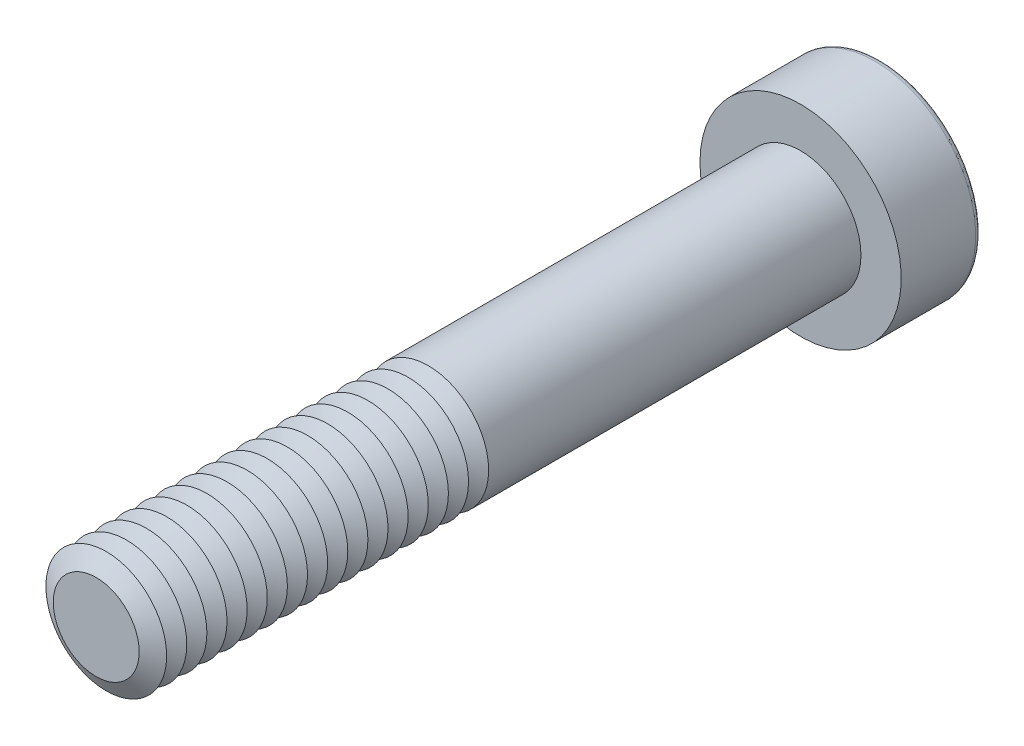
ISO-10303-21;
HEADER;
FILE_DESCRIPTION(('STEP AP214'),'2;1');
FILE_NAME('part.step','',(''),(''),'','','');
FILE_SCHEMA(('AUTOMOTIVE_DESIGN { 1 0 10303 214 1 1 1 1 }'));
ENDSEC;
DATA;
#1=APPLICATION_CONTEXT('core data for automotive mechanical design processes');
#2=APPLICATION_PROTOCOL_DEFINITION('international standard','automotive_design',2000,#1);
#3=PRODUCT_CONTEXT('',#1,'mechanical');
#4=PRODUCT('Part','Part','',(#3));
#5=PRODUCT_RELATED_PRODUCT_CATEGORY('part','',(#4));
#6=PRODUCT_DEFINITION_FORMATION('','',#4);
#7=PRODUCT_DEFINITION_CONTEXT('part definition',#1,'design');
#8=PRODUCT_DEFINITION('design','',#6,#7);
#9=PRODUCT_DEFINITION_SHAPE('','',#8);
#10=(LENGTH_UNIT() NAMED_UNIT(*) SI_UNIT(.MILLI.,.METRE.));
#11=(NAMED_UNIT(*) PLANE_ANGLE_UNIT() SI_UNIT($,.RADIAN.));
#12=(NAMED_UNIT(*) SI_UNIT($,.STERADIAN.) SOLID_ANGLE_UNIT());
#13=UNCERTAINTY_MEASURE_WITH_UNIT(LENGTH_MEASURE(1.E-05),#10,'distance_accuracy_value','');
#14=(GEOMETRIC_REPRESENTATION_CONTEXT(3) GLOBAL_UNCERTAINTY_ASSIGNED_CONTEXT((#13)) GLOBAL_UNIT_ASSIGNED_CONTEXT((#10,
#11,#12)) REPRESENTATION_CONTEXT('',''));
#15=CARTESIAN_POINT('',(0.,0.,0.));
#16=DIRECTION('',(0.,0.,1.));
#17=DIRECTION('',(1.,0.,0.));
#18=AXIS2_PLACEMENT_3D('',#15,#16,#17);
#19=CARTESIAN_POINT('',(0.,0.,31.5));
#20=DIRECTION('',(0.,0.,1.));
#21=DIRECTION('',(1.,0.,0.));
#22=AXIS2_PLACEMENT_3D('',#19,#20,#21);
#23=CONICAL_SURFACE('',#22,3.,1.0471975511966);
#24=CARTESIAN_POINT('',(0.,0.,31.));
#25=DIRECTION('',(0.,0.,1.));
#26=DIRECTION('',(1.,0.,0.));
#27=AXIS2_PLACEMENT_3D('',#24,#25,#26);
#28=CIRCLE('',#27,2.13397459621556);
#29=CARTESIAN_POINT('',(2.13397459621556,0.,31.));
#30=VERTEX_POINT('',#29);
#31=EDGE_CURVE('E310',#30,#30,#28,.T.);
#32=ORIENTED_EDGE('',*,*,#31,.T.);
#33=EDGE_LOOP('',(#32));
#34=FACE_BOUND('',#33,.T.);
#35=CARTESIAN_POINT('',(0.,0.,31.5));
#36=DIRECTION('',(0.,0.,1.));
#37=DIRECTION('',(1.,0.,0.));
#38=AXIS2_PLACEMENT_3D('',#35,#36,#37);
#39=CIRCLE('',#38,3.);
#40=CARTESIAN_POINT('',(3.,0.,31.5));
#41=VERTEX_POINT('',#40);
#42=EDGE_CURVE('E313',#41,#41,#39,.T.);
#43=ORIENTED_EDGE('',*,*,#42,.F.);
#44=EDGE_LOOP('',(#43));
#45=FACE_BOUND('',#44,.T.);
#46=ADVANCED_FACE('F39',(#34,#45),#23,.T.);
#47=CARTESIAN_POINT('',(0.,0.,31.));
#48=DIRECTION('',(0.,0.,-1.));
#49=DIRECTION('',(-1.,0.,0.));
#50=AXIS2_PLACEMENT_3D('',#47,#48,#49);
#51=CONICAL_SURFACE('',#50,2.13397459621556,1.0471975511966);
#52=CARTESIAN_POINT('',(0.,0.,30.5));
#53=DIRECTION('',(0.,0.,1.));
#54=DIRECTION('',(1.,0.,0.));
#55=AXIS2_PLACEMENT_3D('',#52,#53,#54);
#56=CIRCLE('',#55,3.);
#57=CARTESIAN_POINT('',(3.,0.,30.5));
#58=VERTEX_POINT('',#57);
#59=EDGE_CURVE('E321',#58,#58,#56,.T.);
#60=ORIENTED_EDGE('',*,*,#59,.T.);
#61=EDGE_LOOP('',(#60));
#62=FACE_BOUND('',#61,.T.);
#63=ORIENTED_EDGE('',*,*,#31,.F.);
#64=EDGE_LOOP('',(#63));
#65=FACE_BOUND('',#64,.T.);
#66=ADVANCED_FACE('F244',(#62,#65),#51,.T.);
#67=CARTESIAN_POINT('',(0.,0.,35.));
#68=DIRECTION('',(0.,0.,1.));
#69=DIRECTION('',(1.,0.,0.));
#70=AXIS2_PLACEMENT_3D('',#67,#68,#69);
#71=PLANE('',#70);
#72=CARTESIAN_POINT('',(0.,0.,35.));
#73=DIRECTION('',(0.,0.,1.));
#74=DIRECTION('',(1.,0.,0.));
#75=AXIS2_PLACEMENT_3D('',#72,#73,#74);
#76=CIRCLE('',#75,2.13397459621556);
#77=CARTESIAN_POINT('',(2.13397459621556,0.,35.));
#78=VERTEX_POINT('',#77);
#79=EDGE_CURVE('E173',#78,#78,#76,.T.);
#80=ORIENTED_EDGE('',*,*,#79,.T.);
#81=EDGE_LOOP('',(#80));
#82=FACE_BOUND('',#81,.T.);
#83=ADVANCED_FACE('F250',(#82),#71,.T.);
#84=CARTESIAN_POINT('',(0.,0.,35.));
#85=DIRECTION('',(0.,0.,-1.));
#86=DIRECTION('',(-1.,0.,0.));
#87=AXIS2_PLACEMENT_3D('',#84,#85,#86);
#88=CONICAL_SURFACE('',#87,2.13397459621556,1.0471975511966);
#89=CARTESIAN_POINT('',(0.,0.,34.5));
#90=DIRECTION('',(0.,0.,1.));
#91=DIRECTION('',(1.,0.,0.));
#92=AXIS2_PLACEMENT_3D('',#89,#90,#91);
#93=CIRCLE('',#92,3.);
#94=CARTESIAN_POINT('',(3.,0.,34.5));
#95=VERTEX_POINT('',#94);
#96=EDGE_CURVE('E290',#95,#95,#93,.T.);
#97=ORIENTED_EDGE('',*,*,#96,.T.);
#98=EDGE_LOOP('',(#97));
#99=FACE_BOUND('',#98,.T.);
#100=ORIENTED_EDGE('',*,*,#79,.F.);
#101=EDGE_LOOP('',(#100));
#102=FACE_BOUND('',#101,.T.);
#103=ADVANCED_FACE('F198',(#99,#102),#88,.T.);
#104=CARTESIAN_POINT('',(0.,0.,34.5));
#105=DIRECTION('',(0.,0.,1.));
#106=DIRECTION('',(1.,0.,0.));
#107=AXIS2_PLACEMENT_3D('',#104,#105,#106);
#108=CONICAL_SURFACE('',#107,3.,1.0471975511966);
#109=CARTESIAN_POINT('',(0.,0.,34.));
#110=DIRECTION('',(0.,0.,1.));
#111=DIRECTION('',(1.,0.,0.));
#112=AXIS2_PLACEMENT_3D('',#109,#110,#111);
#113=CIRCLE('',#112,2.13397459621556);
#114=CARTESIAN_POINT('',(2.13397459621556,0.,34.));
#115=VERTEX_POINT('',#114);
#116=EDGE_CURVE('E287',#115,#115,#113,.T.);
#117=ORIENTED_EDGE('',*,*,#116,.T.);
#118=EDGE_LOOP('',(#117));
#119=FACE_BOUND('',#118,.T.);
#120=ORIENTED_EDGE('',*,*,#96,.F.);
#121=EDGE_LOOP('',(#120));
#122=FACE_BOUND('',#121,.T.);
#123=ADVANCED_FACE('F276',(#119,#122),#108,.T.);
#124=CARTESIAN_POINT('',(0.,0.,34.));
#125=DIRECTION('',(0.,0.,-1.));
#126=DIRECTION('',(-1.,0.,0.));
#127=AXIS2_PLACEMENT_3D('',#124,#125,#126);
#128=CONICAL_SURFACE('',#127,2.13397459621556,1.0471975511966);
#129=CARTESIAN_POINT('',(0.,0.,33.5));
#130=DIRECTION('',(0.,0.,1.));
#131=DIRECTION('',(1.,0.,0.));
#132=AXIS2_PLACEMENT_3D('',#129,#130,#131);
#133=CIRCLE('',#132,3.);
#134=CARTESIAN_POINT('',(3.,0.,33.5));
#135=VERTEX_POINT('',#134);
#136=EDGE_CURVE('E297',#135,#135,#133,.T.);
#137=ORIENTED_EDGE('',*,*,#136,.T.);
#138=EDGE_LOOP('',(#137));
#139=FACE_BOUND('',#138,.T.);
#140=ORIENTED_EDGE('',*,*,#116,.F.);
#141=EDGE_LOOP('',(#140));
#142=FACE_BOUND('',#141,.T.);
#143=ADVANCED_FACE('F273',(#139,#142),#128,.T.);
#144=CARTESIAN_POINT('',(0.,0.,33.5));
#145=DIRECTION('',(0.,0.,1.));
#146=DIRECTION('',(1.,0.,0.));
#147=AXIS2_PLACEMENT_3D('',#144,#145,#146);
#148=CONICAL_SURFACE('',#147,3.,1.0471975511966);
#149=CARTESIAN_POINT('',(0.,0.,33.));
#150=DIRECTION('',(0.,0.,1.));
#151=DIRECTION('',(1.,0.,0.));
#152=AXIS2_PLACEMENT_3D('',#149,#150,#151);
#153=CIRCLE('',#152,2.13397459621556);
#154=CARTESIAN_POINT('',(2.13397459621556,0.,33.));
#155=VERTEX_POINT('',#154);
#156=EDGE_CURVE('E292',#155,#155,#153,.T.);
#157=ORIENTED_EDGE('',*,*,#156,.T.);
#158=EDGE_LOOP('',(#157));
#159=FACE_BOUND('',#158,.T.);
#160=ORIENTED_EDGE('',*,*,#136,.F.);
#161=EDGE_LOOP('',(#160));
#162=FACE_BOUND('',#161,.T.);
#163=ADVANCED_FACE('F269',(#159,#162),#148,.T.);
#164=CARTESIAN_POINT('',(0.,0.,33.));
#165=DIRECTION('',(0.,0.,-1.));
#166=DIRECTION('',(-1.,0.,0.));
#167=AXIS2_PLACEMENT_3D('',#164,#165,#166);
#168=CONICAL_SURFACE('',#167,2.13397459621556,1.0471975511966);
#169=CARTESIAN_POINT('',(0.,0.,32.5));
#170=DIRECTION('',(0.,0.,1.));
#171=DIRECTION('',(1.,0.,0.));
#172=AXIS2_PLACEMENT_3D('',#169,#170,#171);
#173=CIRCLE('',#172,3.);
#174=CARTESIAN_POINT('',(3.,0.,32.5));
#175=VERTEX_POINT('',#174);
#176=EDGE_CURVE('E306',#175,#175,#173,.T.);
#177=ORIENTED_EDGE('',*,*,#176,.T.);
#178=EDGE_LOOP('',(#177));
#179=FACE_BOUND('',#178,.T.);
#180=ORIENTED_EDGE('',*,*,#156,.F.);
#181=EDGE_LOOP('',(#180));
#182=FACE_BOUND('',#181,.T.);
#183=ADVANCED_FACE('F265',(#179,#182),#168,.T.);
#184=CARTESIAN_POINT('',(0.,0.,32.5));
#185=DIRECTION('',(0.,0.,1.));
#186=DIRECTION('',(1.,0.,0.));
#187=AXIS2_PLACEMENT_3D('',#184,#185,#186);
#188=CONICAL_SURFACE('',#187,3.,1.0471975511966);
#189=CARTESIAN_POINT('',(0.,0.,32.));
#190=DIRECTION('',(0.,0.,1.));
#191=DIRECTION('',(1.,0.,0.));
#192=AXIS2_PLACEMENT_3D('',#189,#190,#191);
#193=CIRCLE('',#192,2.13397459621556);
#194=CARTESIAN_POINT('',(2.13397459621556,0.,32.));
#195=VERTEX_POINT('',#194);
#196=EDGE_CURVE('E302',#195,#195,#193,.T.);
#197=ORIENTED_EDGE('',*,*,#196,.T.);
#198=EDGE_LOOP('',(#197));
#199=FACE_BOUND('',#198,.T.);
#200=ORIENTED_EDGE('',*,*,#176,.F.);
#201=EDGE_LOOP('',(#200));
#202=FACE_BOUND('',#201,.T.);
#203=ADVANCED_FACE('F261',(#199,#202),#188,.T.);
#204=CARTESIAN_POINT('',(0.,0.,32.));
#205=DIRECTION('',(0.,0.,-1.));
#206=DIRECTION('',(-1.,0.,0.));
#207=AXIS2_PLACEMENT_3D('',#204,#205,#206);
#208=CONICAL_SURFACE('',#207,2.13397459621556,1.0471975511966);
#209=ORIENTED_EDGE('',*,*,#42,.T.);
#210=EDGE_LOOP('',(#209));
#211=FACE_BOUND('',#210,.T.);
#212=ORIENTED_EDGE('',*,*,#196,.F.);
#213=EDGE_LOOP('',(#212));
#214=FACE_BOUND('',#213,.T.);
#215=ADVANCED_FACE('F257',(#211,#214),#208,.T.);
#216=CARTESIAN_POINT('',(0.,0.,30.5));
#217=DIRECTION('',(0.,0.,1.));
#218=DIRECTION('',(1.,0.,0.));
#219=AXIS2_PLACEMENT_3D('',#216,#217,#218);
#220=CONICAL_SURFACE('',#219,3.,1.0471975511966);
#221=CARTESIAN_POINT('',(0.,0.,30.));
#222=DIRECTION('',(0.,0.,1.));
#223=DIRECTION('',(1.,0.,0.));
#224=AXIS2_PLACEMENT_3D('',#221,#222,#223);
#225=CIRCLE('',#224,2.13397459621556);
#226=CARTESIAN_POINT('',(2.13397459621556,0.,30.));
#227=VERTEX_POINT('',#226);
#228=EDGE_CURVE('E317',#227,#227,#225,.T.);
#229=ORIENTED_EDGE('',*,*,#228,.T.);
#230=EDGE_LOOP('',(#229));
#231=FACE_BOUND('',#230,.T.);
#232=ORIENTED_EDGE('',*,*,#59,.F.);
#233=EDGE_LOOP('',(#232));
#234=FACE_BOUND('',#233,.T.);
#235=ADVANCED_FACE('F260',(#231,#234),#220,.T.);
#236=CARTESIAN_POINT('',(0.,0.,30.));
#237=DIRECTION('',(0.,0.,-1.));
#238=DIRECTION('',(-1.,0.,0.));
#239=AXIS2_PLACEMENT_3D('',#236,#237,#238);
#240=CONICAL_SURFACE('',#239,2.13397459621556,1.0471975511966);
#241=CARTESIAN_POINT('',(0.,0.,29.5));
#242=DIRECTION('',(0.,0.,1.));
#243=DIRECTION('',(1.,0.,0.));
#244=AXIS2_PLACEMENT_3D('',#241,#242,#243);
#245=CIRCLE('',#244,3.);
#246=CARTESIAN_POINT('',(3.,0.,29.5));
#247=VERTEX_POINT('',#246);
#248=EDGE_CURVE('E329',#247,#247,#245,.T.);
#249=ORIENTED_EDGE('',*,*,#248,.T.);
#250=EDGE_LOOP('',(#249));
#251=FACE_BOUND('',#250,.T.);
#252=ORIENTED_EDGE('',*,*,#228,.F.);
#253=EDGE_LOOP('',(#252));
#254=FACE_BOUND('',#253,.T.);
#255=ADVANCED_FACE('F510',(#251,#254),#240,.T.);
#256=CARTESIAN_POINT('',(0.,0.,29.5));
#257=DIRECTION('',(0.,0.,1.));
#258=DIRECTION('',(1.,0.,0.));
#259=AXIS2_PLACEMENT_3D('',#256,#257,#258);
#260=CONICAL_SURFACE('',#259,3.,1.0471975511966);
#261=CARTESIAN_POINT('',(0.,0.,29.));
#262=DIRECTION('',(0.,0.,1.));
#263=DIRECTION('',(1.,0.,0.));
#264=AXIS2_PLACEMENT_3D('',#261,#262,#263);
#265=CIRCLE('',#264,2.13397459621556);
#266=CARTESIAN_POINT('',(2.13397459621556,0.,29.));
#267=VERTEX_POINT('',#266);
#268=EDGE_CURVE('E325',#267,#267,#265,.T.);
#269=ORIENTED_EDGE('',*,*,#268,.T.);
#270=EDGE_LOOP('',(#269));
#271=FACE_BOUND('',#270,.T.);
#272=ORIENTED_EDGE('',*,*,#248,.F.);
#273=EDGE_LOOP('',(#272));
#274=FACE_BOUND('',#273,.T.);
#275=ADVANCED_FACE('F506',(#271,#274),#260,.T.);
#276=CARTESIAN_POINT('',(0.,0.,29.));
#277=DIRECTION('',(0.,0.,-1.));
#278=DIRECTION('',(-1.,0.,0.));
#279=AXIS2_PLACEMENT_3D('',#276,#277,#278);
#280=CONICAL_SURFACE('',#279,2.13397459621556,1.0471975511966);
#281=CARTESIAN_POINT('',(0.,0.,28.5));
#282=DIRECTION('',(0.,0.,1.));
#283=DIRECTION('',(1.,0.,0.));
#284=AXIS2_PLACEMENT_3D('',#281,#282,#283);
#285=CIRCLE('',#284,3.);
#286=CARTESIAN_POINT('',(3.,0.,28.5));
#287=VERTEX_POINT('',#286);
#288=EDGE_CURVE('E337',#287,#287,#285,.T.);
#289=ORIENTED_EDGE('',*,*,#288,.T.);
#290=EDGE_LOOP('',(#289));
#291=FACE_BOUND('',#290,.T.);
#292=ORIENTED_EDGE('',*,*,#268,.F.);
#293=EDGE_LOOP('',(#292));
#294=FACE_BOUND('',#293,.T.);
#295=ADVANCED_FACE('F502',(#291,#294),#280,.T.);
#296=CARTESIAN_POINT('',(0.,0.,28.5));
#297=DIRECTION('',(0.,0.,1.));
#298=DIRECTION('',(1.,0.,0.));
#299=AXIS2_PLACEMENT_3D('',#296,#297,#298);
#300=CONICAL_SURFACE('',#299,3.,1.0471975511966);
#301=CARTESIAN_POINT('',(0.,0.,28.));
#302=DIRECTION('',(0.,0.,1.));
#303=DIRECTION('',(1.,0.,0.));
#304=AXIS2_PLACEMENT_3D('',#301,#302,#303);
#305=CIRCLE('',#304,2.13397459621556);
#306=CARTESIAN_POINT('',(2.13397459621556,0.,28.));
#307=VERTEX_POINT('',#306);
#308=EDGE_CURVE('E333',#307,#307,#305,.T.);
#309=ORIENTED_EDGE('',*,*,#308,.T.);
#310=EDGE_LOOP('',(#309));
#311=FACE_BOUND('',#310,.T.);
#312=ORIENTED_EDGE('',*,*,#288,.F.);
#313=EDGE_LOOP('',(#312));
#314=FACE_BOUND('',#313,.T.);
#315=ADVANCED_FACE('F498',(#311,#314),#300,.T.);
#316=CARTESIAN_POINT('',(0.,0.,28.));
#317=DIRECTION('',(0.,0.,-1.));
#318=DIRECTION('',(-1.,0.,0.));
#319=AXIS2_PLACEMENT_3D('',#316,#317,#318);
#320=CONICAL_SURFACE('',#319,2.13397459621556,1.0471975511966);
#321=CARTESIAN_POINT('',(0.,0.,27.5));
#322=DIRECTION('',(0.,0.,1.));
#323=DIRECTION('',(1.,0.,0.));
#324=AXIS2_PLACEMENT_3D('',#321,#322,#323);
#325=CIRCLE('',#324,3.);
#326=CARTESIAN_POINT('',(3.,0.,27.5));
#327=VERTEX_POINT('',#326);
#328=EDGE_CURVE('E345',#327,#327,#325,.T.);
#329=ORIENTED_EDGE('',*,*,#328,.T.);
#330=EDGE_LOOP('',(#329));
#331=FACE_BOUND('',#330,.T.);
#332=ORIENTED_EDGE('',*,*,#308,.F.);
#333=EDGE_LOOP('',(#332));
#334=FACE_BOUND('',#333,.T.);
#335=ADVANCED_FACE('F494',(#331,#334),#320,.T.);
#336=CARTESIAN_POINT('',(0.,0.,27.5));
#337=DIRECTION('',(0.,0.,1.));
#338=DIRECTION('',(1.,0.,0.));
#339=AXIS2_PLACEMENT_3D('',#336,#337,#338);
#340=CONICAL_SURFACE('',#339,3.,1.0471975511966);
#341=CARTESIAN_POINT('',(0.,0.,27.));
#342=DIRECTION('',(0.,0.,1.));
#343=DIRECTION('',(1.,0.,0.));
#344=AXIS2_PLACEMENT_3D('',#341,#342,#343);
#345=CIRCLE('',#344,2.13397459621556);
#346=CARTESIAN_POINT('',(2.13397459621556,0.,27.));
#347=VERTEX_POINT('',#346);
#348=EDGE_CURVE('E341',#347,#347,#345,.T.);
#349=ORIENTED_EDGE('',*,*,#348,.T.);
#350=EDGE_LOOP('',(#349));
#351=FACE_BOUND('',#350,.T.);
#352=ORIENTED_EDGE('',*,*,#328,.F.);
#353=EDGE_LOOP('',(#352));
#354=FACE_BOUND('',#353,.T.);
#355=ADVANCED_FACE('F490',(#351,#354),#340,.T.);
#356=CARTESIAN_POINT('',(0.,0.,27.));
#357=DIRECTION('',(0.,0.,-1.));
#358=DIRECTION('',(-1.,0.,0.));
#359=AXIS2_PLACEMENT_3D('',#356,#357,#358);
#360=CONICAL_SURFACE('',#359,2.13397459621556,1.0471975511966);
#361=CARTESIAN_POINT('',(0.,0.,26.5));
#362=DIRECTION('',(0.,0.,1.));
#363=DIRECTION('',(1.,0.,0.));
#364=AXIS2_PLACEMENT_3D('',#361,#362,#363);
#365=CIRCLE('',#364,3.);
#366=CARTESIAN_POINT('',(3.,0.,26.5));
#367=VERTEX_POINT('',#366);
#368=EDGE_CURVE('E353',#367,#367,#365,.T.);
#369=ORIENTED_EDGE('',*,*,#368,.T.);
#370=EDGE_LOOP('',(#369));
#371=FACE_BOUND('',#370,.T.);
#372=ORIENTED_EDGE('',*,*,#348,.F.);
#373=EDGE_LOOP('',(#372));
#374=FACE_BOUND('',#373,.T.);
#375=ADVANCED_FACE('F486',(#371,#374),#360,.T.);
#376=CARTESIAN_POINT('',(0.,0.,26.5));
#377=DIRECTION('',(0.,0.,1.));
#378=DIRECTION('',(1.,0.,0.));
#379=AXIS2_PLACEMENT_3D('',#376,#377,#378);
#380=CONICAL_SURFACE('',#379,3.,1.0471975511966);
#381=CARTESIAN_POINT('',(0.,0.,26.));
#382=DIRECTION('',(0.,0.,1.));
#383=DIRECTION('',(1.,0.,0.));
#384=AXIS2_PLACEMENT_3D('',#381,#382,#383);
#385=CIRCLE('',#384,2.13397459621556);
#386=CARTESIAN_POINT('',(2.13397459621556,0.,26.));
#387=VERTEX_POINT('',#386);
#388=EDGE_CURVE('E349',#387,#387,#385,.T.);
#389=ORIENTED_EDGE('',*,*,#388,.T.);
#390=EDGE_LOOP('',(#389));
#391=FACE_BOUND('',#390,.T.);
#392=ORIENTED_EDGE('',*,*,#368,.F.);
#393=EDGE_LOOP('',(#392));
#394=FACE_BOUND('',#393,.T.);
#395=ADVANCED_FACE('F482',(#391,#394),#380,.T.);
#396=CARTESIAN_POINT('',(0.,0.,26.));
#397=DIRECTION('',(0.,0.,-1.));
#398=DIRECTION('',(-1.,0.,0.));
#399=AXIS2_PLACEMENT_3D('',#396,#397,#398);
#400=CONICAL_SURFACE('',#399,2.13397459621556,1.0471975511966);
#401=CARTESIAN_POINT('',(0.,0.,25.5));
#402=DIRECTION('',(0.,0.,1.));
#403=DIRECTION('',(1.,0.,0.));
#404=AXIS2_PLACEMENT_3D('',#401,#402,#403);
#405=CIRCLE('',#404,3.);
#406=CARTESIAN_POINT('',(3.,0.,25.5));
#407=VERTEX_POINT('',#406);
#408=EDGE_CURVE('E361',#407,#407,#405,.T.);
#409=ORIENTED_EDGE('',*,*,#408,.T.);
#410=EDGE_LOOP('',(#409));
#411=FACE_BOUND('',#410,.T.);
#412=ORIENTED_EDGE('',*,*,#388,.F.);
#413=EDGE_LOOP('',(#412));
#414=FACE_BOUND('',#413,.T.);
#415=ADVANCED_FACE('F478',(#411,#414),#400,.T.);
#416=CARTESIAN_POINT('',(0.,0.,25.5));
#417=DIRECTION('',(0.,0.,1.));
#418=DIRECTION('',(1.,0.,0.));
#419=AXIS2_PLACEMENT_3D('',#416,#417,#418);
#420=CONICAL_SURFACE('',#419,3.,1.0471975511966);
#421=CARTESIAN_POINT('',(0.,0.,25.));
#422=DIRECTION('',(0.,0.,1.));
#423=DIRECTION('',(1.,0.,0.));
#424=AXIS2_PLACEMENT_3D('',#421,#422,#423);
#425=CIRCLE('',#424,2.13397459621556);
#426=CARTESIAN_POINT('',(2.13397459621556,0.,25.));
#427=VERTEX_POINT('',#426);
#428=EDGE_CURVE('E357',#427,#427,#425,.T.);
#429=ORIENTED_EDGE('',*,*,#428,.T.);
#430=EDGE_LOOP('',(#429));
#431=FACE_BOUND('',#430,.T.);
#432=ORIENTED_EDGE('',*,*,#408,.F.);
#433=EDGE_LOOP('',(#432));
#434=FACE_BOUND('',#433,.T.);
#435=ADVANCED_FACE('F474',(#431,#434),#420,.T.);
#436=CARTESIAN_POINT('',(0.,0.,25.));
#437=DIRECTION('',(0.,0.,-1.));
#438=DIRECTION('',(-1.,0.,0.));
#439=AXIS2_PLACEMENT_3D('',#436,#437,#438);
#440=CONICAL_SURFACE('',#439,2.13397459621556,1.0471975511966);
#441=CARTESIAN_POINT('',(0.,0.,24.5));
#442=DIRECTION('',(0.,0.,1.));
#443=DIRECTION('',(1.,0.,0.));
#444=AXIS2_PLACEMENT_3D('',#441,#442,#443);
#445=CIRCLE('',#444,3.);
#446=CARTESIAN_POINT('',(3.,0.,24.5));
#447=VERTEX_POINT('',#446);
#448=EDGE_CURVE('E369',#447,#447,#445,.T.);
#449=ORIENTED_EDGE('',*,*,#448,.T.);
#450=EDGE_LOOP('',(#449));
#451=FACE_BOUND('',#450,.T.);
#452=ORIENTED_EDGE('',*,*,#428,.F.);
#453=EDGE_LOOP('',(#452));
#454=FACE_BOUND('',#453,.T.);
#455=ADVANCED_FACE('F470',(#451,#454),#440,.T.);
#456=CARTESIAN_POINT('',(0.,0.,24.5));
#457=DIRECTION('',(0.,0.,1.));
#458=DIRECTION('',(1.,0.,0.));
#459=AXIS2_PLACEMENT_3D('',#456,#457,#458);
#460=CONICAL_SURFACE('',#459,3.,1.0471975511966);
#461=CARTESIAN_POINT('',(0.,0.,24.));
#462=DIRECTION('',(0.,0.,1.));
#463=DIRECTION('',(1.,0.,0.));
#464=AXIS2_PLACEMENT_3D('',#461,#462,#463);
#465=CIRCLE('',#464,2.13397459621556);
#466=CARTESIAN_POINT('',(2.13397459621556,0.,24.));
#467=VERTEX_POINT('',#466);
#468=EDGE_CURVE('E365',#467,#467,#465,.T.);
#469=ORIENTED_EDGE('',*,*,#468,.T.);
#470=EDGE_LOOP('',(#469));
#471=FACE_BOUND('',#470,.T.);
#472=ORIENTED_EDGE('',*,*,#448,.F.);
#473=EDGE_LOOP('',(#472));
#474=FACE_BOUND('',#473,.T.);
#475=ADVANCED_FACE('F466',(#471,#474),#460,.T.);
#476=CARTESIAN_POINT('',(0.,0.,24.));
#477=DIRECTION('',(0.,0.,-1.));
#478=DIRECTION('',(-1.,0.,0.));
#479=AXIS2_PLACEMENT_3D('',#476,#477,#478);
#480=CONICAL_SURFACE('',#479,2.13397459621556,1.0471975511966);
#481=CARTESIAN_POINT('',(0.,0.,23.5));
#482=DIRECTION('',(0.,0.,1.));
#483=DIRECTION('',(1.,0.,0.));
#484=AXIS2_PLACEMENT_3D('',#481,#482,#483);
#485=CIRCLE('',#484,3.);
#486=CARTESIAN_POINT('',(3.,0.,23.5));
#487=VERTEX_POINT('',#486);
#488=EDGE_CURVE('E377',#487,#487,#485,.T.);
#489=ORIENTED_EDGE('',*,*,#488,.T.);
#490=EDGE_LOOP('',(#489));
#491=FACE_BOUND('',#490,.T.);
#492=ORIENTED_EDGE('',*,*,#468,.F.);
#493=EDGE_LOOP('',(#492));
#494=FACE_BOUND('',#493,.T.);
#495=ADVANCED_FACE('F462',(#491,#494),#480,.T.);
#496=CARTESIAN_POINT('',(0.,0.,23.5));
#497=DIRECTION('',(0.,0.,1.));
#498=DIRECTION('',(1.,0.,0.));
#499=AXIS2_PLACEMENT_3D('',#496,#497,#498);
#500=CONICAL_SURFACE('',#499,3.,1.0471975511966);
#501=CARTESIAN_POINT('',(0.,0.,23.));
#502=DIRECTION('',(0.,0.,1.));
#503=DIRECTION('',(1.,0.,0.));
#504=AXIS2_PLACEMENT_3D('',#501,#502,#503);
#505=CIRCLE('',#504,2.13397459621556);
#506=CARTESIAN_POINT('',(2.13397459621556,0.,23.));
#507=VERTEX_POINT('',#506);
#508=EDGE_CURVE('E373',#507,#507,#505,.T.);
#509=ORIENTED_EDGE('',*,*,#508,.T.);
#510=EDGE_LOOP('',(#509));
#511=FACE_BOUND('',#510,.T.);
#512=ORIENTED_EDGE('',*,*,#488,.F.);
#513=EDGE_LOOP('',(#512));
#514=FACE_BOUND('',#513,.T.);
#515=ADVANCED_FACE('F458',(#511,#514),#500,.T.);
#516=CARTESIAN_POINT('',(0.,0.,23.));
#517=DIRECTION('',(0.,0.,-1.));
#518=DIRECTION('',(-1.,0.,0.));
#519=AXIS2_PLACEMENT_3D('',#516,#517,#518);
#520=CONICAL_SURFACE('',#519,2.13397459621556,1.0471975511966);
#521=CARTESIAN_POINT('',(0.,0.,22.5));
#522=DIRECTION('',(0.,0.,1.));
#523=DIRECTION('',(1.,0.,0.));
#524=AXIS2_PLACEMENT_3D('',#521,#522,#523);
#525=CIRCLE('',#524,3.);
#526=CARTESIAN_POINT('',(3.,0.,22.5));
#527=VERTEX_POINT('',#526);
#528=EDGE_CURVE('E385',#527,#527,#525,.T.);
#529=ORIENTED_EDGE('',*,*,#528,.T.);
#530=EDGE_LOOP('',(#529));
#531=FACE_BOUND('',#530,.T.);
#532=ORIENTED_EDGE('',*,*,#508,.F.);
#533=EDGE_LOOP('',(#532));
#534=FACE_BOUND('',#533,.T.);
#535=ADVANCED_FACE('F454',(#531,#534),#520,.T.);
#536=CARTESIAN_POINT('',(0.,0.,22.5));
#537=DIRECTION('',(0.,0.,1.));
#538=DIRECTION('',(1.,0.,0.));
#539=AXIS2_PLACEMENT_3D('',#536,#537,#538);
#540=CONICAL_SURFACE('',#539,3.,1.0471975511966);
#541=CARTESIAN_POINT('',(0.,0.,22.));
#542=DIRECTION('',(0.,0.,1.));
#543=DIRECTION('',(1.,0.,0.));
#544=AXIS2_PLACEMENT_3D('',#541,#542,#543);
#545=CIRCLE('',#544,2.13397459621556);
#546=CARTESIAN_POINT('',(2.13397459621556,0.,22.));
#547=VERTEX_POINT('',#546);
#548=EDGE_CURVE('E381',#547,#547,#545,.T.);
#549=ORIENTED_EDGE('',*,*,#548,.T.);
#550=EDGE_LOOP('',(#549));
#551=FACE_BOUND('',#550,.T.);
#552=ORIENTED_EDGE('',*,*,#528,.F.);
#553=EDGE_LOOP('',(#552));
#554=FACE_BOUND('',#553,.T.);
#555=ADVANCED_FACE('F450',(#551,#554),#540,.T.);
#556=CARTESIAN_POINT('',(0.,0.,22.));
#557=DIRECTION('',(0.,0.,-1.));
#558=DIRECTION('',(-1.,0.,0.));
#559=AXIS2_PLACEMENT_3D('',#556,#557,#558);
#560=CONICAL_SURFACE('',#559,2.13397459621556,1.0471975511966);
#561=CARTESIAN_POINT('',(0.,0.,21.5));
#562=DIRECTION('',(0.,0.,1.));
#563=DIRECTION('',(1.,0.,0.));
#564=AXIS2_PLACEMENT_3D('',#561,#562,#563);
#565=CIRCLE('',#564,3.);
#566=CARTESIAN_POINT('',(3.,0.,21.5));
#567=VERTEX_POINT('',#566);
#568=EDGE_CURVE('E393',#567,#567,#565,.T.);
#569=ORIENTED_EDGE('',*,*,#568,.T.);
#570=EDGE_LOOP('',(#569));
#571=FACE_BOUND('',#570,.T.);
#572=ORIENTED_EDGE('',*,*,#548,.F.);
#573=EDGE_LOOP('',(#572));
#574=FACE_BOUND('',#573,.T.);
#575=ADVANCED_FACE('F446',(#571,#574),#560,.T.);
#576=CARTESIAN_POINT('',(0.,0.,21.5));
#577=DIRECTION('',(0.,0.,1.));
#578=DIRECTION('',(1.,0.,0.));
#579=AXIS2_PLACEMENT_3D('',#576,#577,#578);
#580=CONICAL_SURFACE('',#579,3.,1.0471975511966);
#581=CARTESIAN_POINT('',(0.,0.,21.));
#582=DIRECTION('',(0.,0.,1.));
#583=DIRECTION('',(1.,0.,0.));
#584=AXIS2_PLACEMENT_3D('',#581,#582,#583);
#585=CIRCLE('',#584,2.13397459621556);
#586=CARTESIAN_POINT('',(2.13397459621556,0.,21.));
#587=VERTEX_POINT('',#586);
#588=EDGE_CURVE('E389',#587,#587,#585,.T.);
#589=ORIENTED_EDGE('',*,*,#588,.T.);
#590=EDGE_LOOP('',(#589));
#591=FACE_BOUND('',#590,.T.);
#592=ORIENTED_EDGE('',*,*,#568,.F.);
#593=EDGE_LOOP('',(#592));
#594=FACE_BOUND('',#593,.T.);
#595=ADVANCED_FACE('F442',(#591,#594),#580,.T.);
#596=CARTESIAN_POINT('',(0.,0.,21.));
#597=DIRECTION('',(0.,0.,-1.));
#598=DIRECTION('',(-1.,0.,0.));
#599=AXIS2_PLACEMENT_3D('',#596,#597,#598);
#600=CONICAL_SURFACE('',#599,2.13397459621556,1.0471975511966);
#601=CARTESIAN_POINT('',(0.,0.,20.5));
#602=DIRECTION('',(0.,0.,1.));
#603=DIRECTION('',(1.,0.,0.));
#604=AXIS2_PLACEMENT_3D('',#601,#602,#603);
#605=CIRCLE('',#604,3.);
#606=CARTESIAN_POINT('',(3.,0.,20.5));
#607=VERTEX_POINT('',#606);
#608=EDGE_CURVE('E401',#607,#607,#605,.T.);
#609=ORIENTED_EDGE('',*,*,#608,.T.);
#610=EDGE_LOOP('',(#609));
#611=FACE_BOUND('',#610,.T.);
#612=ORIENTED_EDGE('',*,*,#588,.F.);
#613=EDGE_LOOP('',(#612));
#614=FACE_BOUND('',#613,.T.);
#615=ADVANCED_FACE('F438',(#611,#614),#600,.T.);
#616=CARTESIAN_POINT('',(0.,0.,20.5));
#617=DIRECTION('',(0.,0.,1.));
#618=DIRECTION('',(1.,0.,0.));
#619=AXIS2_PLACEMENT_3D('',#616,#617,#618);
#620=CONICAL_SURFACE('',#619,3.,1.0471975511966);
#621=CARTESIAN_POINT('',(0.,0.,20.));
#622=DIRECTION('',(0.,0.,1.));
#623=DIRECTION('',(1.,0.,0.));
#624=AXIS2_PLACEMENT_3D('',#621,#622,#623);
#625=CIRCLE('',#624,2.13397459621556);
#626=CARTESIAN_POINT('',(2.13397459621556,0.,20.));
#627=VERTEX_POINT('',#626);
#628=EDGE_CURVE('E397',#627,#627,#625,.T.);
#629=ORIENTED_EDGE('',*,*,#628,.T.);
#630=EDGE_LOOP('',(#629));
#631=FACE_BOUND('',#630,.T.);
#632=ORIENTED_EDGE('',*,*,#608,.F.);
#633=EDGE_LOOP('',(#632));
#634=FACE_BOUND('',#633,.T.);
#635=ADVANCED_FACE('F433',(#631,#634),#620,.T.);
#636=CARTESIAN_POINT('',(0.,0.,20.));
#637=DIRECTION('',(0.,0.,-1.));
#638=DIRECTION('',(-1.,0.,0.));
#639=AXIS2_PLACEMENT_3D('',#636,#637,#638);
#640=CONICAL_SURFACE('',#639,2.13397459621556,1.0471975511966);
#641=CARTESIAN_POINT('',(0.,0.,19.5));
#642=DIRECTION('',(0.,0.,1.));
#643=DIRECTION('',(1.,0.,0.));
#644=AXIS2_PLACEMENT_3D('',#641,#642,#643);
#645=CIRCLE('',#644,3.);
#646=CARTESIAN_POINT('',(3.,0.,19.5));
#647=VERTEX_POINT('',#646);
#648=EDGE_CURVE('E413',#647,#647,#645,.T.);
#649=ORIENTED_EDGE('',*,*,#648,.T.);
#650=EDGE_LOOP('',(#649));
#651=FACE_BOUND('',#650,.T.);
#652=ORIENTED_EDGE('',*,*,#628,.F.);
#653=EDGE_LOOP('',(#652));
#654=FACE_BOUND('',#653,.T.);
#655=ADVANCED_FACE('F419',(#651,#654),#640,.T.);
#656=CARTESIAN_POINT('',(0.,0.,19.5));
#657=DIRECTION('',(0.,0.,1.));
#658=DIRECTION('',(1.,0.,0.));
#659=AXIS2_PLACEMENT_3D('',#656,#657,#658);
#660=CONICAL_SURFACE('',#659,3.,1.0471975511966);
#661=CARTESIAN_POINT('',(0.,0.,19.));
#662=DIRECTION('',(0.,0.,1.));
#663=DIRECTION('',(1.,0.,0.));
#664=AXIS2_PLACEMENT_3D('',#661,#662,#663);
#665=CIRCLE('',#664,2.13397459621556);
#666=CARTESIAN_POINT('',(2.13397459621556,0.,19.));
#667=VERTEX_POINT('',#666);
#668=EDGE_CURVE('E405',#667,#667,#665,.T.);
#669=ORIENTED_EDGE('',*,*,#668,.T.);
#670=EDGE_LOOP('',(#669));
#671=FACE_BOUND('',#670,.T.);
#672=ORIENTED_EDGE('',*,*,#648,.F.);
#673=EDGE_LOOP('',(#672));
#674=FACE_BOUND('',#673,.T.);
#675=ADVANCED_FACE('F422',(#671,#674),#660,.T.);
#676=CARTESIAN_POINT('',(0.,0.,19.));
#677=DIRECTION('',(0.,0.,-1.));
#678=DIRECTION('',(-1.,0.,0.));
#679=AXIS2_PLACEMENT_3D('',#676,#677,#678);
#680=CONICAL_SURFACE('',#679,2.13397459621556,1.0471975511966);
#681=CARTESIAN_POINT('',(0.,0.,18.5));
#682=DIRECTION('',(0.,0.,1.));
#683=DIRECTION('',(1.,0.,0.));
#684=AXIS2_PLACEMENT_3D('',#681,#682,#683);
#685=CIRCLE('',#684,3.);
#686=CARTESIAN_POINT('',(3.,0.,18.5));
#687=VERTEX_POINT('',#686);
#688=EDGE_CURVE('E409',#687,#687,#685,.T.);
#689=ORIENTED_EDGE('',*,*,#688,.T.);
#690=EDGE_LOOP('',(#689));
#691=FACE_BOUND('',#690,.T.);
#692=ORIENTED_EDGE('',*,*,#668,.F.);
#693=EDGE_LOOP('',(#692));
#694=FACE_BOUND('',#693,.T.);
#695=ADVANCED_FACE('F424',(#691,#694),#680,.T.);
#696=CARTESIAN_POINT('',(0.,0.,-1.));
#697=DIRECTION('',(0.,0.,-1.));
#698=DIRECTION('',(-1.,0.,0.));
#699=AXIS2_PLACEMENT_3D('',#696,#697,#698);
#700=CONICAL_SURFACE('',#699,2.,1.0471975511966);
#701=CARTESIAN_POINT('',(0.,0.,0.154700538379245));
#702=VERTEX_POINT('',#701);
#703=VERTEX_LOOP('',#702);
#704=FACE_BOUND('',#703,.T.);
#705=CARTESIAN_POINT('',(0.,0.,-1.));
#706=DIRECTION('',(0.,0.,-1.));
#707=DIRECTION('',(-1.,0.,0.));
#708=AXIS2_PLACEMENT_3D('',#705,#706,#707);
#709=CIRCLE('',#708,2.);
#710=CARTESIAN_POINT('',(-1.73205080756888,0.999999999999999,-1.));
#711=VERTEX_POINT('',#710);
#712=CARTESIAN_POINT('',(0.,2.,-1.));
#713=VERTEX_POINT('',#712);
#714=EDGE_CURVE('E149',#711,#713,#709,.T.);
#715=ORIENTED_EDGE('',*,*,#714,.T.);
#716=CARTESIAN_POINT('',(0.,0.,-1.));
#717=DIRECTION('',(0.,0.,-1.));
#718=DIRECTION('',(-1.,0.,0.));
#719=AXIS2_PLACEMENT_3D('',#716,#717,#718);
#720=CIRCLE('',#719,2.);
#721=CARTESIAN_POINT('',(1.73205080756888,1.,-1.));
#722=VERTEX_POINT('',#721);
#723=EDGE_CURVE('E54',#713,#722,#720,.T.);
#724=ORIENTED_EDGE('',*,*,#723,.T.);
#725=CARTESIAN_POINT('',(1.73205080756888,-0.999999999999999,-1.));
#726=VERTEX_POINT('',#725);
#727=EDGE_CURVE('E1027',#722,#726,#720,.T.);
#728=ORIENTED_EDGE('',*,*,#727,.T.);
#729=CARTESIAN_POINT('',(0.,-2.,-1.));
#730=VERTEX_POINT('',#729);
#731=EDGE_CURVE('E1025',#726,#730,#720,.T.);
#732=ORIENTED_EDGE('',*,*,#731,.T.);
#733=CARTESIAN_POINT('',(-1.73205080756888,-0.999999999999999,-1.));
#734=VERTEX_POINT('',#733);
#735=EDGE_CURVE('E1020',#730,#734,#720,.T.);
#736=ORIENTED_EDGE('',*,*,#735,.T.);
#737=EDGE_CURVE('E1018',#734,#711,#720,.T.);
#738=ORIENTED_EDGE('',*,*,#737,.T.);
#739=EDGE_LOOP('',(#715,#724,#728,#732,#736,#738));
#740=FACE_BOUND('',#739,.T.);
#741=ADVANCED_FACE('F200',(#704,#740),#700,.F.);
#742=CARTESIAN_POINT('',(0.,0.,-1.));
#743=DIRECTION('',(0.,0.,-1.));
#744=DIRECTION('',(-1.,0.,0.));
#745=AXIS2_PLACEMENT_3D('',#742,#743,#744);
#746=PLANE('',#745);
#747=ORIENTED_EDGE('',*,*,#723,.F.);
#748=DIRECTION('',(1.,0.,0.));
#749=VECTOR('',#748,1.);
#750=CARTESIAN_POINT('',(-1.15470053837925,2.,-1.));
#751=LINE('',#750,#749);
#752=CARTESIAN_POINT('',(1.15470053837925,2.,-1.));
#753=VERTEX_POINT('',#752);
#754=EDGE_CURVE('E1067',#713,#753,#751,.T.);
#755=ORIENTED_EDGE('',*,*,#754,.T.);
#756=DIRECTION('',(0.5,-0.866025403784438,0.));
#757=VECTOR('',#756,1.);
#758=CARTESIAN_POINT('',(1.15470053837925,2.,-1.));
#759=LINE('',#758,#757);
#760=EDGE_CURVE('E155',#753,#722,#759,.T.);
#761=ORIENTED_EDGE('',*,*,#760,.T.);
#762=EDGE_LOOP('',(#747,#755,#761));
#763=FACE_BOUND('',#762,.T.);
#764=ADVANCED_FACE('F605',(#763),#746,.T.);
#765=ORIENTED_EDGE('',*,*,#727,.F.);
#766=CARTESIAN_POINT('',(2.3094010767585,0.,-1.));
#767=VERTEX_POINT('',#766);
#768=EDGE_CURVE('E1069',#722,#767,#759,.T.);
#769=ORIENTED_EDGE('',*,*,#768,.T.);
#770=DIRECTION('',(-0.5,-0.866025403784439,0.));
#771=VECTOR('',#770,1.);
#772=CARTESIAN_POINT('',(2.3094010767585,0.,-1.));
#773=LINE('',#772,#771);
#774=EDGE_CURVE('E1040',#767,#726,#773,.T.);
#775=ORIENTED_EDGE('',*,*,#774,.T.);
#776=EDGE_LOOP('',(#765,#769,#775));
#777=FACE_BOUND('',#776,.T.);
#778=ADVANCED_FACE('F615',(#777),#746,.T.);
#779=ORIENTED_EDGE('',*,*,#731,.F.);
#780=CARTESIAN_POINT('',(1.15470053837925,-2.,-1.));
#781=VERTEX_POINT('',#780);
#782=EDGE_CURVE('E1042',#726,#781,#773,.T.);
#783=ORIENTED_EDGE('',*,*,#782,.T.);
#784=DIRECTION('',(-1.,0.,0.));
#785=VECTOR('',#784,1.);
#786=CARTESIAN_POINT('',(1.15470053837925,-2.,-1.));
#787=LINE('',#786,#785);
#788=EDGE_CURVE('E992',#781,#730,#787,.T.);
#789=ORIENTED_EDGE('',*,*,#788,.T.);
#790=EDGE_LOOP('',(#779,#783,#789));
#791=FACE_BOUND('',#790,.T.);
#792=ADVANCED_FACE('F625',(#791),#746,.T.);
#793=ORIENTED_EDGE('',*,*,#735,.F.);
#794=CARTESIAN_POINT('',(-1.15470053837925,-2.,-1.));
#795=VERTEX_POINT('',#794);
#796=EDGE_CURVE('E1036',#730,#795,#787,.T.);
#797=ORIENTED_EDGE('',*,*,#796,.T.);
#798=DIRECTION('',(-0.5,0.866025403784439,0.));
#799=VECTOR('',#798,1.);
#800=CARTESIAN_POINT('',(-1.15470053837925,-2.,-1.));
#801=LINE('',#800,#799);
#802=EDGE_CURVE('E1038',#795,#734,#801,.T.);
#803=ORIENTED_EDGE('',*,*,#802,.T.);
#804=EDGE_LOOP('',(#793,#797,#803));
#805=FACE_BOUND('',#804,.T.);
#806=ADVANCED_FACE('F633',(#805),#746,.T.);
#807=ORIENTED_EDGE('',*,*,#737,.F.);
#808=CARTESIAN_POINT('',(-2.3094010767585,0.,-1.));
#809=VERTEX_POINT('',#808);
#810=EDGE_CURVE('E1044',#734,#809,#801,.T.);
#811=ORIENTED_EDGE('',*,*,#810,.T.);
#812=DIRECTION('',(0.5,0.866025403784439,0.));
#813=VECTOR('',#812,1.);
#814=CARTESIAN_POINT('',(-2.3094010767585,0.,-1.));
#815=LINE('',#814,#813);
#816=EDGE_CURVE('E158',#809,#711,#815,.T.);
#817=ORIENTED_EDGE('',*,*,#816,.T.);
#818=EDGE_LOOP('',(#807,#811,#817));
#819=FACE_BOUND('',#818,.T.);
#820=ADVANCED_FACE('F230',(#819),#746,.T.);
#821=ORIENTED_EDGE('',*,*,#714,.F.);
#822=CARTESIAN_POINT('',(-1.15470053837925,2.,-1.));
#823=VERTEX_POINT('',#822);
#824=EDGE_CURVE('E1052',#711,#823,#815,.T.);
#825=ORIENTED_EDGE('',*,*,#824,.T.);
#826=EDGE_CURVE('E1066',#823,#713,#751,.T.);
#827=ORIENTED_EDGE('',*,*,#826,.T.);
#828=EDGE_LOOP('',(#821,#825,#827));
#829=FACE_BOUND('',#828,.T.);
#830=ADVANCED_FACE('F617',(#829),#746,.T.);
#831=CARTESIAN_POINT('',(-1.15470053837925,2.,-1.));
#832=DIRECTION('',(0.,1.,0.));
#833=DIRECTION('',(0.,0.,1.));
#834=AXIS2_PLACEMENT_3D('',#831,#832,#833);
#835=PLANE('',#834);
#836=DIRECTION('',(0.,0.,-1.));
#837=VECTOR('',#836,1.);
#838=CARTESIAN_POINT('',(-1.15470053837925,2.,-1.));
#839=LINE('',#838,#837);
#840=CARTESIAN_POINT('',(-1.15470053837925,2.,-4.));
#841=VERTEX_POINT('',#840);
#842=EDGE_CURVE('E147',#823,#841,#839,.T.);
#843=ORIENTED_EDGE('',*,*,#842,.T.);
#844=CARTESIAN_POINT('',(-3.01440758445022,2.,-4.35051689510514));
#845=CARTESIAN_POINT('',(-2.92409762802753,2.,-4.33035636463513));
#846=CARTESIAN_POINT('',(-2.83373054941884,2.,-4.31045254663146));
#847=CARTESIAN_POINT('',(-2.65285291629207,2.,-4.27128852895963));
#848=CARTESIAN_POINT('',(-2.562342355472,2.,-4.25202835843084));
#849=CARTESIAN_POINT('',(-2.29037985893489,2.,-4.19537300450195));
#850=CARTESIAN_POINT('',(-2.10868043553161,2.,-4.15914446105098));
#851=CARTESIAN_POINT('',(-1.74597297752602,2.,-4.09171688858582));
#852=CARTESIAN_POINT('',(-1.56497266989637,2.,-4.06047686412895));
#853=CARTESIAN_POINT('',(-1.20186568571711,2.,-4.00513826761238));
#854=CARTESIAN_POINT('',(-1.01975924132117,2.,-3.98103824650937));
#855=CARTESIAN_POINT('',(-0.744747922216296,2.,-3.9525901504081));
#856=CARTESIAN_POINT('',(-0.652245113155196,2.,-3.9443671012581));
#857=CARTESIAN_POINT('',(-0.467020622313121,2.,-3.93099406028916));
#858=CARTESIAN_POINT('',(-0.374298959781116,2.,-3.92584380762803));
#859=CARTESIAN_POINT('',(-0.188764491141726,2.,-3.91891540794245));
#860=CARTESIAN_POINT('',(-0.0959517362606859,2.,-3.91713591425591));
#861=CARTESIAN_POINT('',(0.0896753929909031,2.,-3.91705786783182));
#862=CARTESIAN_POINT('',(0.182489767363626,2.,-3.91875932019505));
#863=CARTESIAN_POINT('',(0.368369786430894,2.,-3.92554892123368));
#864=CARTESIAN_POINT('',(0.461434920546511,2.,-3.93065079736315));
#865=CARTESIAN_POINT('',(0.647346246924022,2.,-3.94395663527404));
#866=CARTESIAN_POINT('',(0.740192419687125,2.,-3.95216086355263));
#867=CARTESIAN_POINT('',(1.01841374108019,2.,-3.98081777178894));
#868=CARTESIAN_POINT('',(1.2033713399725,2.,-4.00531018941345));
#869=CARTESIAN_POINT('',(1.57694396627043,2.,-4.06236202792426));
#870=CARTESIAN_POINT('',(1.76552771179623,2.,-4.09511615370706));
#871=CARTESIAN_POINT('',(2.14178491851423,2.,-4.1655706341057));
#872=CARTESIAN_POINT('',(2.32945822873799,2.,-4.20327178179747));
#873=CARTESIAN_POINT('',(2.70417911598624,2.,-4.28188312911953));
#874=CARTESIAN_POINT('',(2.89122649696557,2.,-4.32279425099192));
#875=CARTESIAN_POINT('',(3.26484478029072,2.,-4.40674298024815));
#876=CARTESIAN_POINT('',(3.45141567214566,2.,-4.44978063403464));
#877=CARTESIAN_POINT('',(3.821938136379,2.,-4.53678178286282));
#878=CARTESIAN_POINT('',(4.00589388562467,2.,-4.58072756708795));
#879=CARTESIAN_POINT('',(4.37356350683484,2.,-4.66963526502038));
#880=CARTESIAN_POINT('',(4.55727737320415,2.,-4.71459720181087));
#881=CARTESIAN_POINT('',(4.9242660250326,2.,-4.80519833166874));
#882=CARTESIAN_POINT('',(5.10754106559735,2.,-4.85083649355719));
#883=CARTESIAN_POINT('',(5.47394280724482,2.,-4.94267693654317));
#884=CARTESIAN_POINT('',(5.65706951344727,2.,-4.98887919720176));
#885=CARTESIAN_POINT('',(5.84014583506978,2.,-5.03527803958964));
#886=B_SPLINE_CURVE_WITH_KNOTS('',3,(#844,#845,#846,#847,#848,#849,#850,#851,#852,#853,#854,
#855,#856,#857,#858,#859,#860,#861,#862,#863,#864,#865,#866,#867,#868,#869,#870,#871,#872,#873,
#874,#875,#876,#877,#878,#879,#880,#881,#882,#883,#884,#885),.UNSPECIFIED.,.F.,.F.,(4,2,2,2,2,2,
2,2,2,2,2,2,2,2,2,2,2,2,2,2,4),(0.,0.277597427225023,0.555207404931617,1.11099118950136,
1.66194208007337,2.21278108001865,2.49134108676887,2.76987744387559,3.04830249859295,
3.32672796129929,3.60628428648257,3.88586463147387,4.44532615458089,5.0194589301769,
5.59368385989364,6.16807437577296,6.74247743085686,7.30986991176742,7.87727529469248,
8.44388991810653,9.01048407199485),.UNSPECIFIED.);
#887=CARTESIAN_POINT('',(1.15470053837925,2.,-4.));
#888=VERTEX_POINT('',#887);
#889=EDGE_CURVE('E124',#841,#888,#886,.T.);
#890=ORIENTED_EDGE('',*,*,#889,.T.);
#891=DIRECTION('',(0.,0.,-1.));
#892=VECTOR('',#891,1.);
#893=CARTESIAN_POINT('',(1.15470053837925,2.,-1.));
#894=LINE('',#893,#892);
#895=EDGE_CURVE('E143',#753,#888,#894,.T.);
#896=ORIENTED_EDGE('',*,*,#895,.F.);
#897=ORIENTED_EDGE('',*,*,#754,.F.);
#898=ORIENTED_EDGE('',*,*,#826,.F.);
#899=EDGE_LOOP('',(#843,#890,#896,#897,#898));
#900=FACE_BOUND('',#899,.T.);
#901=ADVANCED_FACE('F141',(#900),#835,.F.);
#902=CARTESIAN_POINT('',(1.15470053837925,2.,-1.));
#903=DIRECTION('',(0.866025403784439,0.5,0.));
#904=DIRECTION('',(-0.5,0.866025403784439,0.));
#905=AXIS2_PLACEMENT_3D('',#902,#903,#904);
#906=PLANE('',#905);
#907=ORIENTED_EDGE('',*,*,#895,.T.);
#908=CARTESIAN_POINT('',(1.15458506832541,2.0002,-4.00003094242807));
#909=CARTESIAN_POINT('',(1.20254643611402,1.91712847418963,-3.98717294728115));
#910=CARTESIAN_POINT('',(1.25059477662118,1.83390630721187,-3.97549990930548));
#911=CARTESIAN_POINT('',(1.3468611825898,1.66716800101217,-3.95499135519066));
#912=CARTESIAN_POINT('',(1.39507930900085,1.58365175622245,-3.94615699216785));
#913=CARTESIAN_POINT('',(1.49139287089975,1.41683177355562,-3.93184164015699));
#914=CARTESIAN_POINT('',(1.53948765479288,1.33352916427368,-3.92634357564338));
#915=CARTESIAN_POINT('',(1.63573857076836,1.1668176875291,-3.91897122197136));
#916=CARTESIAN_POINT('',(1.68389468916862,1.08340884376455,-3.91709623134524));
#917=CARTESIAN_POINT('',(1.78020692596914,0.916591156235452,-3.91709623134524));
#918=CARTESIAN_POINT('',(1.82836304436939,0.833182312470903,-3.91897122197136));
#919=CARTESIAN_POINT('',(1.92461396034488,0.666470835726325,-3.92634357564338));
#920=CARTESIAN_POINT('',(1.972708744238,0.583168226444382,-3.93184164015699));
#921=CARTESIAN_POINT('',(2.06902230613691,0.416348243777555,-3.94615699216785));
#922=CARTESIAN_POINT('',(2.11724043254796,0.332831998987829,-3.95499135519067));
#923=CARTESIAN_POINT('',(2.21350683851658,0.16609369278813,-3.97549990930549));
#924=CARTESIAN_POINT('',(2.26155517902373,0.0828715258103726,-3.98717294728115));
#925=CARTESIAN_POINT('',(2.30951654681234,-0.000199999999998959,-4.00003094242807));
#926=B_SPLINE_CURVE_WITH_KNOTS('',3,(#908,#909,#910,#911,#912,#913,#914,#915,#916,#917,#918,
#919,#920,#921,#922,#923,#924,#925),.UNSPECIFIED.,.F.,.F.,(4,2,2,2,2,2,2,2,4),(0.,
0.29035724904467,0.580832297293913,0.869807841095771,1.15872743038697,1.44764701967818,
1.73662256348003,2.02709761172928,2.31745486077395),.UNSPECIFIED.);
#927=CARTESIAN_POINT('',(2.3094010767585,0.,-4.));
#928=VERTEX_POINT('',#927);
#929=EDGE_CURVE('E11',#888,#928,#926,.T.);
#930=ORIENTED_EDGE('',*,*,#929,.T.);
#931=DIRECTION('',(0.,0.,-1.));
#932=VECTOR('',#931,1.);
#933=CARTESIAN_POINT('',(2.3094010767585,0.,-1.));
#934=LINE('',#933,#932);
#935=EDGE_CURVE('E157',#767,#928,#934,.T.);
#936=ORIENTED_EDGE('',*,*,#935,.F.);
#937=ORIENTED_EDGE('',*,*,#768,.F.);
#938=ORIENTED_EDGE('',*,*,#760,.F.);
#939=EDGE_LOOP('',(#907,#930,#936,#937,#938));
#940=FACE_BOUND('',#939,.T.);
#941=ADVANCED_FACE('F152',(#940),#906,.F.);
#942=CARTESIAN_POINT('',(2.3094010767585,0.,-1.));
#943=DIRECTION('',(0.866025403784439,-0.5,0.));
#944=DIRECTION('',(0.5,0.866025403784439,0.));
#945=AXIS2_PLACEMENT_3D('',#942,#943,#944);
#946=PLANE('',#945);
#947=ORIENTED_EDGE('',*,*,#935,.T.);
#948=CARTESIAN_POINT('',(2.30951654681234,0.000200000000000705,-4.00003094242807));
#949=CARTESIAN_POINT('',(2.26155517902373,-0.0828715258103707,-3.98717294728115));
#950=CARTESIAN_POINT('',(2.21350683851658,-0.166093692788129,-3.97549990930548));
#951=CARTESIAN_POINT('',(2.11724043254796,-0.332831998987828,-3.95499135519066));
#952=CARTESIAN_POINT('',(2.06902230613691,-0.416348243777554,-3.94615699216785));
#953=CARTESIAN_POINT('',(1.972708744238,-0.583168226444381,-3.93184164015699));
#954=CARTESIAN_POINT('',(1.92461396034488,-0.666470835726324,-3.92634357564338));
#955=CARTESIAN_POINT('',(1.82836304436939,-0.833182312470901,-3.91897122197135));
#956=CARTESIAN_POINT('',(1.78020692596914,-0.91659115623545,-3.91709623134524));
#957=CARTESIAN_POINT('',(1.68389468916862,-1.08340884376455,-3.91709623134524));
#958=CARTESIAN_POINT('',(1.63573857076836,-1.1668176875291,-3.91897122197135));
#959=CARTESIAN_POINT('',(1.53948765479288,-1.33352916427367,-3.92634357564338));
#960=CARTESIAN_POINT('',(1.49139287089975,-1.41683177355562,-3.93184164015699));
#961=CARTESIAN_POINT('',(1.39507930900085,-1.58365175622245,-3.94615699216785));
#962=CARTESIAN_POINT('',(1.3468611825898,-1.66716800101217,-3.95499135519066));
#963=CARTESIAN_POINT('',(1.25059477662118,-1.83390630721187,-3.97549990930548));
#964=CARTESIAN_POINT('',(1.20254643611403,-1.91712847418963,-3.98717294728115));
#965=CARTESIAN_POINT('',(1.15458506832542,-2.0002,-4.00003094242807));
#966=B_SPLINE_CURVE_WITH_KNOTS('',3,(#948,#949,#950,#951,#952,#953,#954,#955,#956,#957,#958,
#959,#960,#961,#962,#963,#964,#965),.UNSPECIFIED.,.F.,.F.,(4,2,2,2,2,2,2,2,4),(0.,
0.290357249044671,0.580832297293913,0.869807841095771,1.15872743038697,1.44764701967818,
1.73662256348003,2.02709761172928,2.31745486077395),.UNSPECIFIED.);
#967=CARTESIAN_POINT('',(1.15470053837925,-2.,-4.));
#968=VERTEX_POINT('',#967);
#969=EDGE_CURVE('E172',#928,#968,#966,.T.);
#970=ORIENTED_EDGE('',*,*,#969,.T.);
#971=DIRECTION('',(0.,0.,-1.));
#972=VECTOR('',#971,1.);
#973=CARTESIAN_POINT('',(1.15470053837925,-2.,-1.));
#974=LINE('',#973,#972);
#975=EDGE_CURVE('E987',#781,#968,#974,.T.);
#976=ORIENTED_EDGE('',*,*,#975,.F.);
#977=ORIENTED_EDGE('',*,*,#782,.F.);
#978=ORIENTED_EDGE('',*,*,#774,.F.);
#979=EDGE_LOOP('',(#947,#970,#976,#977,#978));
#980=FACE_BOUND('',#979,.T.);
#981=ADVANCED_FACE('F190',(#980),#946,.F.);
#982=CARTESIAN_POINT('',(1.15470053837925,-2.,-1.));
#983=DIRECTION('',(0.,-1.,0.));
#984=DIRECTION('',(0.,0.,-1.));
#985=AXIS2_PLACEMENT_3D('',#982,#983,#984);
#986=PLANE('',#985);
#987=ORIENTED_EDGE('',*,*,#975,.T.);
#988=CARTESIAN_POINT('',(-3.01440758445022,-2.,-4.35051689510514));
#989=CARTESIAN_POINT('',(-2.92409762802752,-2.,-4.33035636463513));
#990=CARTESIAN_POINT('',(-2.83373054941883,-2.,-4.31045254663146));
#991=CARTESIAN_POINT('',(-2.65285291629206,-2.,-4.27128852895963));
#992=CARTESIAN_POINT('',(-2.562342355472,-2.,-4.25202835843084));
#993=CARTESIAN_POINT('',(-2.29037985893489,-2.,-4.19537300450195));
#994=CARTESIAN_POINT('',(-2.10868043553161,-2.,-4.15914446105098));
#995=CARTESIAN_POINT('',(-1.74597297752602,-2.,-4.09171688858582));
#996=CARTESIAN_POINT('',(-1.56497266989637,-2.,-4.06047686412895));
#997=CARTESIAN_POINT('',(-1.20186568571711,-2.,-4.00513826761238));
#998=CARTESIAN_POINT('',(-1.01975924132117,-2.,-3.98103824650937));
#999=CARTESIAN_POINT('',(-0.744747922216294,-2.,-3.9525901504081));
#1000=CARTESIAN_POINT('',(-0.652245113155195,-2.,-3.9443671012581));
#1001=CARTESIAN_POINT('',(-0.46702062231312,-2.,-3.93099406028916));
#1002=CARTESIAN_POINT('',(-0.374298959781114,-2.,-3.92584380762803));
#1003=CARTESIAN_POINT('',(-0.188764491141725,-2.,-3.91891540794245));
#1004=CARTESIAN_POINT('',(-0.0959517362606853,-2.,-3.91713591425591));
#1005=CARTESIAN_POINT('',(0.0896753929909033,-2.,-3.91705786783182));
#1006=CARTESIAN_POINT('',(0.182489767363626,-2.,-3.91875932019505));
#1007=CARTESIAN_POINT('',(0.368369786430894,-2.,-3.92554892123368));
#1008=CARTESIAN_POINT('',(0.461434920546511,-2.,-3.93065079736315));
#1009=CARTESIAN_POINT('',(0.647346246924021,-2.,-3.94395663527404));
#1010=CARTESIAN_POINT('',(0.740192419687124,-2.,-3.95216086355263));
#1011=CARTESIAN_POINT('',(1.01841374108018,-2.,-3.98081777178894));
#1012=CARTESIAN_POINT('',(1.2033713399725,-2.,-4.00531018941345));
#1013=CARTESIAN_POINT('',(1.57694396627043,-2.,-4.06236202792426));
#1014=CARTESIAN_POINT('',(1.76552771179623,-2.,-4.09511615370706));
#1015=CARTESIAN_POINT('',(2.14178491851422,-2.,-4.1655706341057));
#1016=CARTESIAN_POINT('',(2.32945822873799,-2.,-4.20327178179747));
#1017=CARTESIAN_POINT('',(2.70417911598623,-2.,-4.28188312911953));
#1018=CARTESIAN_POINT('',(2.89122649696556,-2.,-4.32279425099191));
#1019=CARTESIAN_POINT('',(3.26484478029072,-2.,-4.40674298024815));
#1020=CARTESIAN_POINT('',(3.45141567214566,-2.,-4.44978063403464));
#1021=CARTESIAN_POINT('',(3.821938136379,-2.,-4.53678178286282));
#1022=CARTESIAN_POINT('',(4.00589388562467,-2.,-4.58072756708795));
#1023=CARTESIAN_POINT('',(4.37356350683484,-2.,-4.66963526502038));
#1024=CARTESIAN_POINT('',(4.55727737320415,-2.,-4.71459720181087));
#1025=CARTESIAN_POINT('',(4.9242660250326,-2.,-4.80519833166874));
#1026=CARTESIAN_POINT('',(5.10754106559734,-2.,-4.85083649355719));
#1027=CARTESIAN_POINT('',(5.47394280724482,-2.,-4.94267693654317));
#1028=CARTESIAN_POINT('',(5.65706951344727,-2.,-4.98887919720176));
#1029=CARTESIAN_POINT('',(5.84014583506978,-2.,-5.03527803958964));
#1030=B_SPLINE_CURVE_WITH_KNOTS('',3,(#988,#989,#990,#991,#992,#993,#994,#995,#996,#997,#998,
#999,#1000,#1001,#1002,#1003,#1004,#1005,#1006,#1007,#1008,#1009,#1010,#1011,#1012,#1013,#1014,
#1015,#1016,#1017,#1018,#1019,#1020,#1021,#1022,#1023,#1024,#1025,#1026,#1027,#1028,#1029),
.UNSPECIFIED.,.F.,.F.,(4,2,2,2,2,2,2,2,2,2,2,2,2,2,2,2,2,2,2,2,4),(0.,0.277597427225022,
0.555207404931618,1.11099118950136,1.66194208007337,2.21278108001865,2.49134108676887,
2.76987744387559,3.04830249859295,3.32672796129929,3.60628428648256,3.88586463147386,
4.44532615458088,5.01945893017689,5.59368385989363,6.16807437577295,6.74247743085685,
7.30986991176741,7.87727529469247,8.44388991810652,9.01048407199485),.UNSPECIFIED.);
#1031=CARTESIAN_POINT('',(-1.15470053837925,-2.,-4.));
#1032=VERTEX_POINT('',#1031);
#1033=EDGE_CURVE('E183',#968,#1032,#1030,.F.);
#1034=ORIENTED_EDGE('',*,*,#1033,.T.);
#1035=DIRECTION('',(0.,0.,-1.));
#1036=VECTOR('',#1035,1.);
#1037=CARTESIAN_POINT('',(-1.15470053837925,-2.,-1.));
#1038=LINE('',#1037,#1036);
#1039=EDGE_CURVE('E994',#795,#1032,#1038,.T.);
#1040=ORIENTED_EDGE('',*,*,#1039,.F.);
#1041=ORIENTED_EDGE('',*,*,#796,.F.);
#1042=ORIENTED_EDGE('',*,*,#788,.F.);
#1043=EDGE_LOOP('',(#987,#1034,#1040,#1041,#1042));
#1044=FACE_BOUND('',#1043,.T.);
#1045=ADVANCED_FACE('F233',(#1044),#986,.F.);
#1046=CARTESIAN_POINT('',(-1.15470053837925,-2.,-1.));
#1047=DIRECTION('',(-0.866025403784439,-0.5,0.));
#1048=DIRECTION('',(0.5,-0.866025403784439,0.));
#1049=AXIS2_PLACEMENT_3D('',#1046,#1047,#1048);
#1050=PLANE('',#1049);
#1051=ORIENTED_EDGE('',*,*,#1039,.T.);
#1052=CARTESIAN_POINT('',(-1.15458506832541,-2.0002,-4.00003094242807));
#1053=CARTESIAN_POINT('',(-1.20254643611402,-1.91712847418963,-3.98717294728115));
#1054=CARTESIAN_POINT('',(-1.25059477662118,-1.83390630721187,-3.97549990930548));
#1055=CARTESIAN_POINT('',(-1.34686118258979,-1.66716800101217,-3.95499135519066));
#1056=CARTESIAN_POINT('',(-1.39507930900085,-1.58365175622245,-3.94615699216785));
#1057=CARTESIAN_POINT('',(-1.49139287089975,-1.41683177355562,-3.93184164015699));
#1058=CARTESIAN_POINT('',(-1.53948765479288,-1.33352916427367,-3.92634357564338));
#1059=CARTESIAN_POINT('',(-1.63573857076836,-1.1668176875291,-3.91897122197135));
#1060=CARTESIAN_POINT('',(-1.68389468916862,-1.08340884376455,-3.91709623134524));
#1061=CARTESIAN_POINT('',(-1.78020692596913,-0.91659115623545,-3.91709623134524));
#1062=CARTESIAN_POINT('',(-1.82836304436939,-0.833182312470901,-3.91897122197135));
#1063=CARTESIAN_POINT('',(-1.92461396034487,-0.666470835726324,-3.92634357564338));
#1064=CARTESIAN_POINT('',(-1.972708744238,-0.583168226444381,-3.93184164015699));
#1065=CARTESIAN_POINT('',(-2.0690223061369,-0.416348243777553,-3.94615699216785));
#1066=CARTESIAN_POINT('',(-2.11724043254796,-0.332831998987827,-3.95499135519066));
#1067=CARTESIAN_POINT('',(-2.21350683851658,-0.166093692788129,-3.97549990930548));
#1068=CARTESIAN_POINT('',(-2.26155517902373,-0.0828715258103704,-3.98717294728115));
#1069=CARTESIAN_POINT('',(-2.30951654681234,0.000200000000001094,-4.00003094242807));
#1070=B_SPLINE_CURVE_WITH_KNOTS('',3,(#1052,#1053,#1054,#1055,#1056,#1057,#1058,#1059,#1060,
#1061,#1062,#1063,#1064,#1065,#1066,#1067,#1068,#1069),.UNSPECIFIED.,.F.,.F.,(4,2,2,2,2,2,2,2,
4),(0.,0.290357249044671,0.580832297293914,0.869807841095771,1.15872743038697,1.44764701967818,
1.73662256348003,2.02709761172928,2.31745486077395),.UNSPECIFIED.);
#1071=CARTESIAN_POINT('',(-2.3094010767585,0.,-4.));
#1072=VERTEX_POINT('',#1071);
#1073=EDGE_CURVE('E207',#1032,#1072,#1070,.T.);
#1074=ORIENTED_EDGE('',*,*,#1073,.T.);
#1075=DIRECTION('',(0.,0.,-1.));
#1076=VECTOR('',#1075,1.);
#1077=CARTESIAN_POINT('',(-2.3094010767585,0.,-1.));
#1078=LINE('',#1077,#1076);
#1079=EDGE_CURVE('E998',#809,#1072,#1078,.T.);
#1080=ORIENTED_EDGE('',*,*,#1079,.F.);
#1081=ORIENTED_EDGE('',*,*,#810,.F.);
#1082=ORIENTED_EDGE('',*,*,#802,.F.);
#1083=EDGE_LOOP('',(#1051,#1074,#1080,#1081,#1082));
#1084=FACE_BOUND('',#1083,.T.);
#1085=ADVANCED_FACE('F228',(#1084),#1050,.F.);
#1086=CARTESIAN_POINT('',(-2.3094010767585,0.,-1.));
#1087=DIRECTION('',(-0.866025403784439,0.5,0.));
#1088=DIRECTION('',(-0.5,-0.866025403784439,0.));
#1089=AXIS2_PLACEMENT_3D('',#1086,#1087,#1088);
#1090=PLANE('',#1089);
#1091=ORIENTED_EDGE('',*,*,#1079,.T.);
#1092=CARTESIAN_POINT('',(-2.30951654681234,-0.00019999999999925,-4.00003094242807));
#1093=CARTESIAN_POINT('',(-2.26155517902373,0.0828715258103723,-3.98717294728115));
#1094=CARTESIAN_POINT('',(-2.21350683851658,0.16609369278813,-3.97549990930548));
#1095=CARTESIAN_POINT('',(-2.11724043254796,0.332831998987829,-3.95499135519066));
#1096=CARTESIAN_POINT('',(-2.0690223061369,0.416348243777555,-3.94615699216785));
#1097=CARTESIAN_POINT('',(-1.972708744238,0.583168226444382,-3.93184164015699));
#1098=CARTESIAN_POINT('',(-1.92461396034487,0.666470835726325,-3.92634357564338));
#1099=CARTESIAN_POINT('',(-1.82836304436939,0.833182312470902,-3.91897122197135));
#1100=CARTESIAN_POINT('',(-1.78020692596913,0.916591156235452,-3.91709623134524));
#1101=CARTESIAN_POINT('',(-1.68389468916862,1.08340884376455,-3.91709623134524));
#1102=CARTESIAN_POINT('',(-1.63573857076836,1.1668176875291,-3.91897122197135));
#1103=CARTESIAN_POINT('',(-1.53948765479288,1.33352916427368,-3.92634357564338));
#1104=CARTESIAN_POINT('',(-1.49139287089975,1.41683177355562,-3.93184164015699));
#1105=CARTESIAN_POINT('',(-1.39507930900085,1.58365175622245,-3.94615699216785));
#1106=CARTESIAN_POINT('',(-1.3468611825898,1.66716800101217,-3.95499135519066));
#1107=CARTESIAN_POINT('',(-1.25059477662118,1.83390630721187,-3.97549990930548));
#1108=CARTESIAN_POINT('',(-1.20254643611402,1.91712847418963,-3.98717294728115));
#1109=CARTESIAN_POINT('',(-1.15458506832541,2.0002,-4.00003094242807));
#1110=B_SPLINE_CURVE_WITH_KNOTS('',3,(#1092,#1093,#1094,#1095,#1096,#1097,#1098,#1099,#1100,
#1101,#1102,#1103,#1104,#1105,#1106,#1107,#1108,#1109),.UNSPECIFIED.,.F.,.F.,(4,2,2,2,2,2,2,2,
4),(0.,0.29035724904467,0.580832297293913,0.869807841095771,1.15872743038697,1.44764701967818,
1.73662256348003,2.02709761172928,2.31745486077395),.UNSPECIFIED.);
#1111=EDGE_CURVE('E150',#1072,#841,#1110,.T.);
#1112=ORIENTED_EDGE('',*,*,#1111,.T.);
#1113=ORIENTED_EDGE('',*,*,#842,.F.);
#1114=ORIENTED_EDGE('',*,*,#824,.F.);
#1115=ORIENTED_EDGE('',*,*,#816,.F.);
#1116=EDGE_LOOP('',(#1091,#1112,#1113,#1114,#1115));
#1117=FACE_BOUND('',#1116,.T.);
#1118=ADVANCED_FACE('F196',(#1117),#1090,.F.);
#1119=CARTESIAN_POINT('',(0.,0.,-4.));
#1120=DIRECTION('',(0.,0.,-1.));
#1121=DIRECTION('',(-1.,0.,0.));
#1122=AXIS2_PLACEMENT_3D('',#1119,#1120,#1121);
#1123=CONICAL_SURFACE('',#1122,2.3094010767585,1.30899693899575);
#1124=CARTESIAN_POINT('',(0.,0.,-4.));
#1125=DIRECTION('',(0.,0.,-1.));
#1126=DIRECTION('',(-1.,0.,0.));
#1127=AXIS2_PLACEMENT_3D('',#1124,#1125,#1126);
#1128=CIRCLE('',#1127,2.3094010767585);
#1129=EDGE_CURVE('E120',#841,#888,#1128,.T.);
#1130=ORIENTED_EDGE('',*,*,#1129,.T.);
#1131=ORIENTED_EDGE('',*,*,#889,.F.);
#1132=EDGE_LOOP('',(#1130,#1131));
#1133=FACE_BOUND('',#1132,.T.);
#1134=ADVANCED_FACE('F122',(#1133),#1123,.F.);
#1135=EDGE_CURVE('E129',#888,#928,#1128,.T.);
#1136=ORIENTED_EDGE('',*,*,#1135,.T.);
#1137=ORIENTED_EDGE('',*,*,#929,.F.);
#1138=EDGE_LOOP('',(#1136,#1137));
#1139=FACE_BOUND('',#1138,.T.);
#1140=ADVANCED_FACE('F133',(#1139),#1123,.F.);
#1141=EDGE_CURVE('E164',#928,#968,#1128,.T.);
#1142=ORIENTED_EDGE('',*,*,#1141,.T.);
#1143=ORIENTED_EDGE('',*,*,#969,.F.);
#1144=EDGE_LOOP('',(#1142,#1143));
#1145=FACE_BOUND('',#1144,.T.);
#1146=ADVANCED_FACE('F698',(#1145),#1123,.F.);
#1147=EDGE_CURVE('E168',#968,#1032,#1128,.T.);
#1148=ORIENTED_EDGE('',*,*,#1147,.T.);
#1149=ORIENTED_EDGE('',*,*,#1033,.F.);
#1150=EDGE_LOOP('',(#1148,#1149));
#1151=FACE_BOUND('',#1150,.T.);
#1152=ADVANCED_FACE('F705',(#1151),#1123,.F.);
#1153=EDGE_CURVE('E67',#1032,#1072,#1128,.T.);
#1154=ORIENTED_EDGE('',*,*,#1153,.T.);
#1155=ORIENTED_EDGE('',*,*,#1073,.F.);
#1156=EDGE_LOOP('',(#1154,#1155));
#1157=FACE_BOUND('',#1156,.T.);
#1158=ADVANCED_FACE('F713',(#1157),#1123,.F.);
#1159=EDGE_CURVE('E60',#1072,#841,#1128,.T.);
#1160=ORIENTED_EDGE('',*,*,#1159,.T.);
#1161=ORIENTED_EDGE('',*,*,#1111,.F.);
#1162=EDGE_LOOP('',(#1160,#1161));
#1163=FACE_BOUND('',#1162,.T.);
#1164=ADVANCED_FACE('F197',(#1163),#1123,.F.);
#1165=CARTESIAN_POINT('',(0.,0.,-4.));
#1166=DIRECTION('',(0.,0.,-1.));
#1167=DIRECTION('',(-1.,0.,0.));
#1168=AXIS2_PLACEMENT_3D('',#1165,#1166,#1167);
#1169=PLANE('',#1168);
#1170=ORIENTED_EDGE('',*,*,#1159,.F.);
#1171=ORIENTED_EDGE('',*,*,#1153,.F.);
#1172=ORIENTED_EDGE('',*,*,#1147,.F.);
#1173=ORIENTED_EDGE('',*,*,#1141,.F.);
#1174=ORIENTED_EDGE('',*,*,#1135,.F.);
#1175=ORIENTED_EDGE('',*,*,#1129,.F.);
#1176=EDGE_LOOP('',(#1170,#1171,#1172,#1173,#1174,#1175));
#1177=FACE_BOUND('',#1176,.T.);
#1178=CARTESIAN_POINT('',(0.,0.,-4.));
#1179=DIRECTION('',(0.,0.,-1.));
#1180=DIRECTION('',(-1.,0.,0.));
#1181=AXIS2_PLACEMENT_3D('',#1178,#1179,#1180);
#1182=CIRCLE('',#1181,4.7);
#1183=CARTESIAN_POINT('',(-4.7,0.,-4.));
#1184=VERTEX_POINT('',#1183);
#1185=EDGE_CURVE('E1012',#1184,#1184,#1182,.T.);
#1186=ORIENTED_EDGE('',*,*,#1185,.T.);
#1187=EDGE_LOOP('',(#1186));
#1188=FACE_BOUND('',#1187,.T.);
#1189=ADVANCED_FACE('F161',(#1177,#1188),#1169,.T.);
#1190=CARTESIAN_POINT('',(0.,0.,-3.7));
#1191=DIRECTION('',(0.,0.,-1.));
#1192=DIRECTION('',(-1.,0.,0.));
#1193=AXIS2_PLACEMENT_3D('',#1190,#1191,#1192);
#1194=TOROIDAL_SURFACE('',#1193,4.7,0.3);
#1195=CARTESIAN_POINT('',(0.,0.,-3.7));
#1196=DIRECTION('',(0.,0.,-1.));
#1197=DIRECTION('',(-1.,0.,0.));
#1198=AXIS2_PLACEMENT_3D('',#1195,#1196,#1197);
#1199=CIRCLE('',#1198,5.);
#1200=CARTESIAN_POINT('',(-5.,0.,-3.7));
#1201=VERTEX_POINT('',#1200);
#1202=EDGE_CURVE('E1015',#1201,#1201,#1199,.F.);
#1203=ORIENTED_EDGE('',*,*,#1202,.F.);
#1204=EDGE_LOOP('',(#1203));
#1205=FACE_BOUND('',#1204,.T.);
#1206=ORIENTED_EDGE('',*,*,#1185,.F.);
#1207=EDGE_LOOP('',(#1206));
#1208=FACE_BOUND('',#1207,.T.);
#1209=ADVANCED_FACE('F41',(#1205,#1208),#1194,.T.);
#1210=CARTESIAN_POINT('',(0.,0.,-4.));
#1211=DIRECTION('',(0.,0.,1.));
#1212=DIRECTION('',(1.,0.,0.));
#1213=AXIS2_PLACEMENT_3D('',#1210,#1211,#1212);
#1214=CYLINDRICAL_SURFACE('',#1213,5.);
#1215=ORIENTED_EDGE('',*,*,#1202,.T.);
#1216=EDGE_LOOP('',(#1215));
#1217=FACE_BOUND('',#1216,.T.);
#1218=CARTESIAN_POINT('',(0.,0.,0.));
#1219=DIRECTION('',(0.,0.,-1.));
#1220=DIRECTION('',(-1.,0.,0.));
#1221=AXIS2_PLACEMENT_3D('',#1218,#1219,#1220);
#1222=CIRCLE('',#1221,5.);
#1223=CARTESIAN_POINT('',(-5.,0.,0.));
#1224=VERTEX_POINT('',#1223);
#1225=EDGE_CURVE('E1004',#1224,#1224,#1222,.T.);
#1226=ORIENTED_EDGE('',*,*,#1225,.T.);
#1227=EDGE_LOOP('',(#1226));
#1228=FACE_BOUND('',#1227,.T.);
#1229=ADVANCED_FACE('F737',(#1217,#1228),#1214,.T.);
#1230=CARTESIAN_POINT('',(0.,0.,0.));
#1231=DIRECTION('',(0.,0.,-1.));
#1232=DIRECTION('',(-1.,0.,0.));
#1233=AXIS2_PLACEMENT_3D('',#1230,#1231,#1232);
#1234=PLANE('',#1233);
#1235=CARTESIAN_POINT('',(0.,0.,0.));
#1236=DIRECTION('',(0.,0.,1.));
#1237=DIRECTION('',(1.,0.,0.));
#1238=AXIS2_PLACEMENT_3D('',#1235,#1236,#1237);
#1239=CIRCLE('',#1238,3.);
#1240=CARTESIAN_POINT('',(3.,0.,0.));
#1241=VERTEX_POINT('',#1240);
#1242=EDGE_CURVE('E1008',#1241,#1241,#1239,.T.);
#1243=ORIENTED_EDGE('',*,*,#1242,.F.);
#1244=EDGE_LOOP('',(#1243));
#1245=FACE_BOUND('',#1244,.T.);
#1246=ORIENTED_EDGE('',*,*,#1225,.F.);
#1247=EDGE_LOOP('',(#1246));
#1248=FACE_BOUND('',#1247,.T.);
#1249=ADVANCED_FACE('F745',(#1245,#1248),#1234,.F.);
#1250=CARTESIAN_POINT('',(0.,0.,35.));
#1251=DIRECTION('',(0.,0.,-1.));
#1252=DIRECTION('',(-1.,0.,0.));
#1253=AXIS2_PLACEMENT_3D('',#1250,#1251,#1252);
#1254=CYLINDRICAL_SURFACE('',#1253,3.);
#1255=ORIENTED_EDGE('',*,*,#1242,.T.);
#1256=EDGE_LOOP('',(#1255));
#1257=FACE_BOUND('',#1256,.T.);
#1258=ORIENTED_EDGE('',*,*,#688,.F.);
#1259=EDGE_LOOP('',(#1258));
#1260=FACE_BOUND('',#1259,.T.);
#1261=ADVANCED_FACE('F754',(#1257,#1260),#1254,.T.);
#1262=CLOSED_SHELL('',(#46,#66,#83,#103,#123,#143,#163,#183,#203,#215,#235,#255,#275,#295,#315,
#335,#355,#375,#395,#415,#435,#455,#475,#495,#515,#535,#555,#575,#595,#615,#635,#655,#675,#695,
#741,#764,#778,#792,#806,#820,#830,#901,#941,#981,#1045,#1085,#1118,#1134,#1140,#1146,#1152,
#1158,#1164,#1189,#1209,#1229,#1249,#1261));
#1263=MANIFOLD_SOLID_BREP('B2',#1262);
#1264=ADVANCED_BREP_SHAPE_REPRESENTATION('',(#18,#1263),#14);
#1265=SHAPE_DEFINITION_REPRESENTATION(#9,#1264);
ENDSEC;
END-ISO-10303-21;
